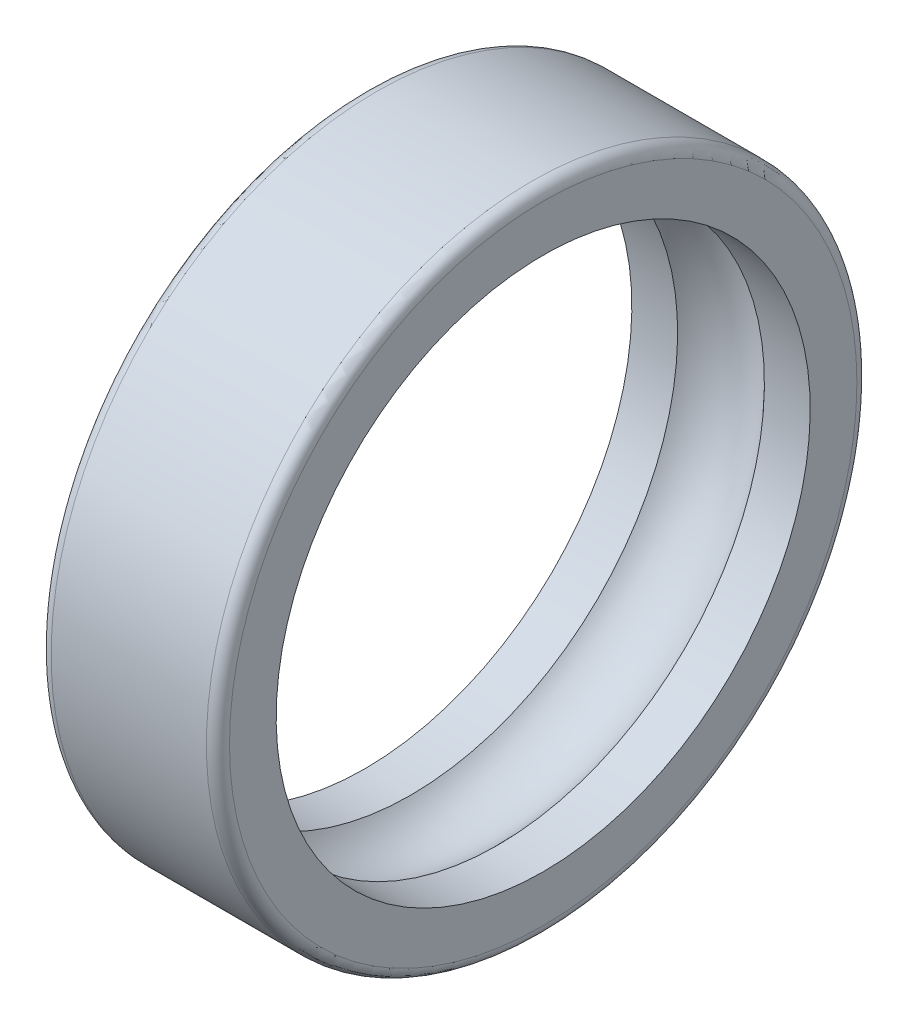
ISO-10303-21;
HEADER;
FILE_DESCRIPTION(('STEP AP214'),'2;1');
FILE_NAME('part.step','',(''),(''),'','','');
FILE_SCHEMA(('AUTOMOTIVE_DESIGN { 1 0 10303 214 1 1 1 1 }'));
ENDSEC;
DATA;
#1=APPLICATION_CONTEXT('core data for automotive mechanical design processes');
#2=APPLICATION_PROTOCOL_DEFINITION('international standard','automotive_design',2000,#1);
#3=PRODUCT_CONTEXT('',#1,'mechanical');
#4=PRODUCT('Part','Part','',(#3));
#5=PRODUCT_RELATED_PRODUCT_CATEGORY('part','',(#4));
#6=PRODUCT_DEFINITION_FORMATION('','',#4);
#7=PRODUCT_DEFINITION_CONTEXT('part definition',#1,'design');
#8=PRODUCT_DEFINITION('design','',#6,#7);
#9=PRODUCT_DEFINITION_SHAPE('','',#8);
#10=(LENGTH_UNIT() NAMED_UNIT(*) SI_UNIT(.MILLI.,.METRE.));
#11=(NAMED_UNIT(*) PLANE_ANGLE_UNIT() SI_UNIT($,.RADIAN.));
#12=(NAMED_UNIT(*) SI_UNIT($,.STERADIAN.) SOLID_ANGLE_UNIT());
#13=UNCERTAINTY_MEASURE_WITH_UNIT(LENGTH_MEASURE(1.E-05),#10,'distance_accuracy_value','');
#14=(GEOMETRIC_REPRESENTATION_CONTEXT(3) GLOBAL_UNCERTAINTY_ASSIGNED_CONTEXT((#13)) GLOBAL_UNIT_ASSIGNED_CONTEXT((#10,
#11,#12)) REPRESENTATION_CONTEXT('',''));
#15=CARTESIAN_POINT('',(0.,0.,0.));
#16=DIRECTION('',(0.,0.,1.));
#17=DIRECTION('',(1.,0.,0.));
#18=AXIS2_PLACEMENT_3D('',#15,#16,#17);
#19=CARTESIAN_POINT('',(1.09999999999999,0.,0.));
#20=DIRECTION('',(-1.,0.,0.));
#21=DIRECTION('',(0.,-1.,0.));
#22=AXIS2_PLACEMENT_3D('',#19,#20,#21);
#23=TOROIDAL_SURFACE('',#22,29.9,1.1);
#24=CARTESIAN_POINT('',(0.,0.,0.));
#25=DIRECTION('',(-1.,0.,0.));
#26=DIRECTION('',(0.,-1.,0.));
#27=AXIS2_PLACEMENT_3D('',#24,#25,#26);
#28=CIRCLE('',#27,29.9);
#29=CARTESIAN_POINT('',(0.,-29.9,0.));
#30=VERTEX_POINT('',#29);
#31=EDGE_CURVE('E10',#30,#30,#28,.T.);
#32=ORIENTED_EDGE('',*,*,#31,.F.);
#33=EDGE_LOOP('',(#32));
#34=FACE_BOUND('',#33,.T.);
#35=CARTESIAN_POINT('',(1.09999999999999,0.,0.));
#36=DIRECTION('',(-1.,0.,0.));
#37=DIRECTION('',(0.,-1.,0.));
#38=AXIS2_PLACEMENT_3D('',#35,#36,#37);
#39=CIRCLE('',#38,31.);
#40=CARTESIAN_POINT('',(1.09999999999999,-31.,0.));
#41=VERTEX_POINT('',#40);
#42=EDGE_CURVE('E58',#41,#41,#39,.T.);
#43=ORIENTED_EDGE('',*,*,#42,.T.);
#44=EDGE_LOOP('',(#43));
#45=FACE_BOUND('',#44,.T.);
#46=ADVANCED_FACE('F30',(#34,#45),#23,.T.);
#47=CARTESIAN_POINT('',(-1.11022302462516E-13,25.45,0.));
#48=DIRECTION('',(1.,0.,0.));
#49=DIRECTION('',(0.,1.,0.));
#50=AXIS2_PLACEMENT_3D('',#47,#48,#49);
#51=PLANE('',#50);
#52=CARTESIAN_POINT('',(0.,0.,0.));
#53=DIRECTION('',(-1.,0.,0.));
#54=DIRECTION('',(0.,-1.,0.));
#55=AXIS2_PLACEMENT_3D('',#52,#53,#54);
#56=CIRCLE('',#55,25.45);
#57=CARTESIAN_POINT('',(0.,-25.45,0.));
#58=VERTEX_POINT('',#57);
#59=EDGE_CURVE('E36',#58,#58,#56,.T.);
#60=ORIENTED_EDGE('',*,*,#59,.F.);
#61=EDGE_LOOP('',(#60));
#62=FACE_BOUND('',#61,.T.);
#63=ORIENTED_EDGE('',*,*,#31,.T.);
#64=EDGE_LOOP('',(#63));
#65=FACE_BOUND('',#64,.T.);
#66=ADVANCED_FACE('F95',(#62,#65),#51,.F.);
#67=CARTESIAN_POINT('',(0.,0.,0.));
#68=DIRECTION('',(-1.,0.,0.));
#69=DIRECTION('',(0.,-1.,0.));
#70=AXIS2_PLACEMENT_3D('',#67,#68,#69);
#71=CYLINDRICAL_SURFACE('',#70,25.45);
#72=CARTESIAN_POINT('',(4.36327424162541,0.,0.));
#73=DIRECTION('',(-1.,0.,0.));
#74=DIRECTION('',(0.,-1.,0.));
#75=AXIS2_PLACEMENT_3D('',#72,#73,#74);
#76=CIRCLE('',#75,25.45);
#77=CARTESIAN_POINT('',(4.36327424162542,-25.45,0.));
#78=VERTEX_POINT('',#77);
#79=EDGE_CURVE('E40',#78,#78,#76,.T.);
#80=ORIENTED_EDGE('',*,*,#79,.F.);
#81=EDGE_LOOP('',(#80));
#82=FACE_BOUND('',#81,.T.);
#83=ORIENTED_EDGE('',*,*,#59,.T.);
#84=EDGE_LOOP('',(#83));
#85=FACE_BOUND('',#84,.T.);
#86=ADVANCED_FACE('F90',(#82,#85),#71,.F.);
#87=CARTESIAN_POINT('',(8.49999999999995,0.,0.));
#88=DIRECTION('',(-1.,0.,0.));
#89=DIRECTION('',(0.,-1.,0.));
#90=AXIS2_PLACEMENT_3D('',#87,#88,#89);
#91=TOROIDAL_SURFACE('',#90,21.75,5.55);
#92=CARTESIAN_POINT('',(12.6367257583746,0.,0.));
#93=DIRECTION('',(-1.,0.,0.));
#94=DIRECTION('',(0.,-1.,0.));
#95=AXIS2_PLACEMENT_3D('',#92,#93,#94);
#96=CIRCLE('',#95,25.45);
#97=CARTESIAN_POINT('',(12.6367257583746,-25.45,0.));
#98=VERTEX_POINT('',#97);
#99=EDGE_CURVE('E44',#98,#98,#96,.T.);
#100=ORIENTED_EDGE('',*,*,#99,.F.);
#101=EDGE_LOOP('',(#100));
#102=FACE_BOUND('',#101,.T.);
#103=ORIENTED_EDGE('',*,*,#79,.T.);
#104=EDGE_LOOP('',(#103));
#105=FACE_BOUND('',#104,.T.);
#106=ADVANCED_FACE('F84',(#102,#105),#91,.F.);
#107=CARTESIAN_POINT('',(0.,0.,0.));
#108=DIRECTION('',(-1.,0.,0.));
#109=DIRECTION('',(0.,-1.,0.));
#110=AXIS2_PLACEMENT_3D('',#107,#108,#109);
#111=CYLINDRICAL_SURFACE('',#110,25.45);
#112=CARTESIAN_POINT('',(17.,0.,0.));
#113=DIRECTION('',(-1.,0.,0.));
#114=DIRECTION('',(0.,-1.,0.));
#115=AXIS2_PLACEMENT_3D('',#112,#113,#114);
#116=CIRCLE('',#115,25.45);
#117=CARTESIAN_POINT('',(17.,-25.45,0.));
#118=VERTEX_POINT('',#117);
#119=EDGE_CURVE('E49',#118,#118,#116,.T.);
#120=ORIENTED_EDGE('',*,*,#119,.F.);
#121=EDGE_LOOP('',(#120));
#122=FACE_BOUND('',#121,.T.);
#123=ORIENTED_EDGE('',*,*,#99,.T.);
#124=EDGE_LOOP('',(#123));
#125=FACE_BOUND('',#124,.T.);
#126=ADVANCED_FACE('F78',(#122,#125),#111,.F.);
#127=CARTESIAN_POINT('',(16.9999999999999,29.9,0.));
#128=DIRECTION('',(-1.,0.,0.));
#129=DIRECTION('',(0.,-1.,0.));
#130=AXIS2_PLACEMENT_3D('',#127,#128,#129);
#131=PLANE('',#130);
#132=CARTESIAN_POINT('',(17.,0.,0.));
#133=DIRECTION('',(-1.,0.,0.));
#134=DIRECTION('',(0.,-1.,0.));
#135=AXIS2_PLACEMENT_3D('',#132,#133,#134);
#136=CIRCLE('',#135,29.9);
#137=CARTESIAN_POINT('',(17.,-29.9,0.));
#138=VERTEX_POINT('',#137);
#139=EDGE_CURVE('E52',#138,#138,#136,.T.);
#140=ORIENTED_EDGE('',*,*,#139,.F.);
#141=EDGE_LOOP('',(#140));
#142=FACE_BOUND('',#141,.T.);
#143=ORIENTED_EDGE('',*,*,#119,.T.);
#144=EDGE_LOOP('',(#143));
#145=FACE_BOUND('',#144,.T.);
#146=ADVANCED_FACE('F72',(#142,#145),#131,.F.);
#147=CARTESIAN_POINT('',(15.9,0.,0.));
#148=DIRECTION('',(-1.,0.,0.));
#149=DIRECTION('',(0.,-1.,0.));
#150=AXIS2_PLACEMENT_3D('',#147,#148,#149);
#151=TOROIDAL_SURFACE('',#150,29.9,1.1);
#152=CARTESIAN_POINT('',(15.9,0.,0.));
#153=DIRECTION('',(-1.,0.,0.));
#154=DIRECTION('',(0.,-1.,0.));
#155=AXIS2_PLACEMENT_3D('',#152,#153,#154);
#156=CIRCLE('',#155,31.);
#157=CARTESIAN_POINT('',(15.9,-31.,0.));
#158=VERTEX_POINT('',#157);
#159=EDGE_CURVE('E55',#158,#158,#156,.T.);
#160=ORIENTED_EDGE('',*,*,#159,.F.);
#161=EDGE_LOOP('',(#160));
#162=FACE_BOUND('',#161,.T.);
#163=ORIENTED_EDGE('',*,*,#139,.T.);
#164=EDGE_LOOP('',(#163));
#165=FACE_BOUND('',#164,.T.);
#166=ADVANCED_FACE('F66',(#162,#165),#151,.T.);
#167=CARTESIAN_POINT('',(0.,0.,0.));
#168=DIRECTION('',(-1.,0.,0.));
#169=DIRECTION('',(0.,-1.,0.));
#170=AXIS2_PLACEMENT_3D('',#167,#168,#169);
#171=CYLINDRICAL_SURFACE('',#170,31.);
#172=ORIENTED_EDGE('',*,*,#42,.F.);
#173=EDGE_LOOP('',(#172));
#174=FACE_BOUND('',#173,.T.);
#175=ORIENTED_EDGE('',*,*,#159,.T.);
#176=EDGE_LOOP('',(#175));
#177=FACE_BOUND('',#176,.T.);
#178=ADVANCED_FACE('F63',(#174,#177),#171,.T.);
#179=CLOSED_SHELL('',(#46,#66,#86,#106,#126,#146,#166,#178));
#180=MANIFOLD_SOLID_BREP('B2',#179);
#181=ADVANCED_BREP_SHAPE_REPRESENTATION('',(#18,#180),#14);
#182=SHAPE_DEFINITION_REPRESENTATION(#9,#181);
ENDSEC;
END-ISO-10303-21;
